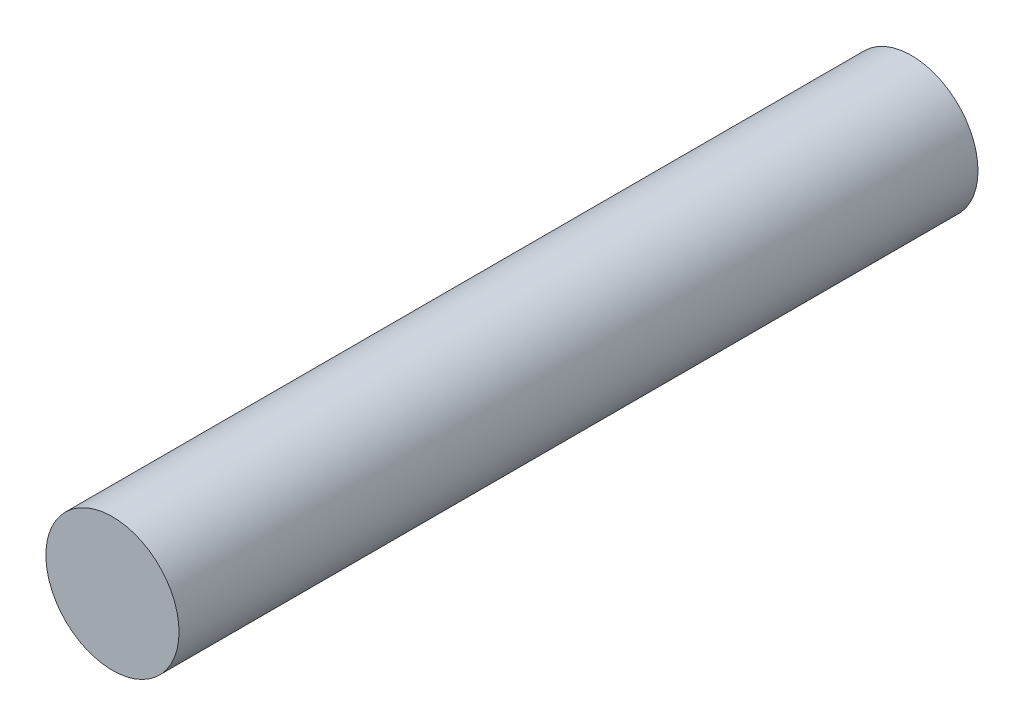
from build123d import *

# Parameters (mm, degrees)
ESQUISSE1_R      = 2
EXTRUSION1_DEPTH = 24


with BuildPart() as part:
    # Esquisse1 → Extrusion1 (new body)
    with BuildSketch(Plane.XY):
        Circle(ESQUISSE1_R)
    extrude(amount=EXTRUSION1_DEPTH)


solid = part.part
